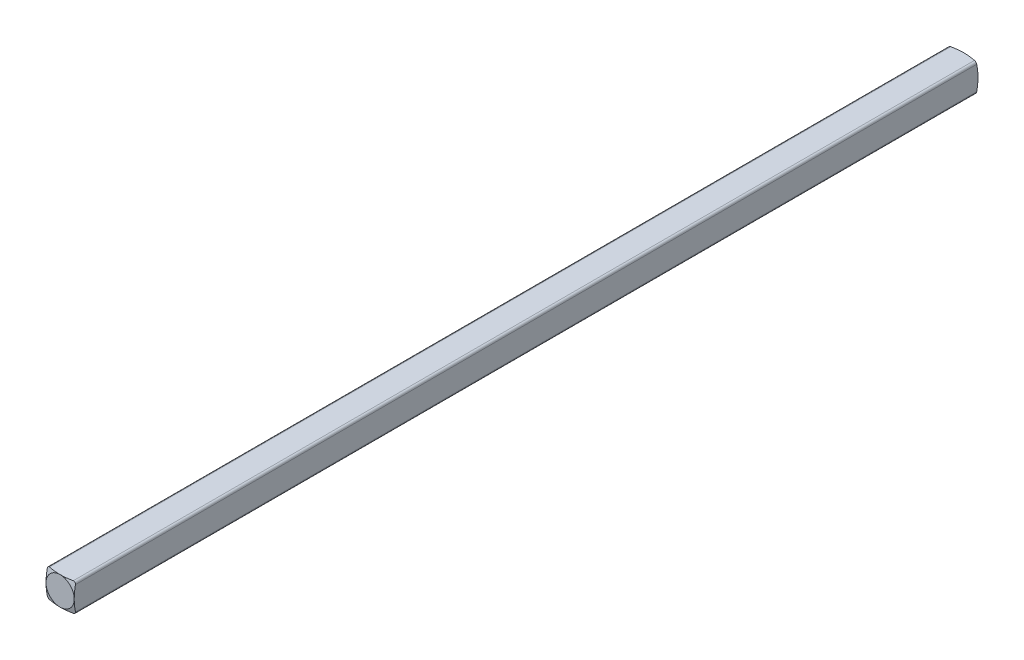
ISO-10303-21;
HEADER;
FILE_DESCRIPTION(('STEP AP214'),'2;1');
FILE_NAME('part.step','',(''),(''),'','','');
FILE_SCHEMA(('AUTOMOTIVE_DESIGN { 1 0 10303 214 1 1 1 1 }'));
ENDSEC;
DATA;
#1=APPLICATION_CONTEXT('core data for automotive mechanical design processes');
#2=APPLICATION_PROTOCOL_DEFINITION('international standard','automotive_design',2000,#1);
#3=PRODUCT_CONTEXT('',#1,'mechanical');
#4=PRODUCT('Part','Part','',(#3));
#5=PRODUCT_RELATED_PRODUCT_CATEGORY('part','',(#4));
#6=PRODUCT_DEFINITION_FORMATION('','',#4);
#7=PRODUCT_DEFINITION_CONTEXT('part definition',#1,'design');
#8=PRODUCT_DEFINITION('design','',#6,#7);
#9=PRODUCT_DEFINITION_SHAPE('','',#8);
#10=(LENGTH_UNIT() NAMED_UNIT(*) SI_UNIT(.MILLI.,.METRE.));
#11=(NAMED_UNIT(*) PLANE_ANGLE_UNIT() SI_UNIT($,.RADIAN.));
#12=(NAMED_UNIT(*) SI_UNIT($,.STERADIAN.) SOLID_ANGLE_UNIT());
#13=UNCERTAINTY_MEASURE_WITH_UNIT(LENGTH_MEASURE(1.E-05),#10,'distance_accuracy_value','');
#14=(GEOMETRIC_REPRESENTATION_CONTEXT(3) GLOBAL_UNCERTAINTY_ASSIGNED_CONTEXT((#13)) GLOBAL_UNIT_ASSIGNED_CONTEXT((#10,
#11,#12)) REPRESENTATION_CONTEXT('',''));
#15=CARTESIAN_POINT('',(0.,0.,0.));
#16=DIRECTION('',(0.,0.,1.));
#17=DIRECTION('',(1.,0.,0.));
#18=AXIS2_PLACEMENT_3D('',#15,#16,#17);
#19=CARTESIAN_POINT('',(-1.53487723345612,-1.585,50.8));
#20=DIRECTION('',(1.,0.,0.));
#21=DIRECTION('',(0.,1.,0.));
#22=AXIS2_PLACEMENT_3D('',#19,#20,#21);
#23=PLANE('',#22);
#24=CARTESIAN_POINT('',(-1.53487723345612,-3.16666521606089,-50.2259021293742));
#25=CARTESIAN_POINT('',(-1.53487723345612,-3.08469064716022,-50.2474134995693));
#26=CARTESIAN_POINT('',(-1.53487723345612,-3.00267602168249,-50.2687725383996));
#27=CARTESIAN_POINT('',(-1.53487723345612,-2.83854664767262,-50.3111088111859));
#28=CARTESIAN_POINT('',(-1.53487723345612,-2.75643189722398,-50.3320860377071));
#29=CARTESIAN_POINT('',(-1.53487723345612,-2.50995900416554,-50.3943162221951));
#30=CARTESIAN_POINT('',(-1.53487723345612,-2.3454255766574,-50.43488001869));
#31=CARTESIAN_POINT('',(-1.53487723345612,-2.01672815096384,-50.5129127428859));
#32=CARTESIAN_POINT('',(-1.53487723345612,-1.85256851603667,-50.550399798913));
#33=CARTESIAN_POINT('',(-1.53487723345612,-1.52315459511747,-50.6208840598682));
#34=CARTESIAN_POINT('',(-1.53487723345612,-1.3578996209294,-50.6538780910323));
#35=CARTESIAN_POINT('',(-1.53487723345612,-1.02346692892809,-50.7128592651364));
#36=CARTESIAN_POINT('',(-1.53487723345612,-0.854267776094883,-50.7387322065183));
#37=CARTESIAN_POINT('',(-1.53487723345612,-0.599515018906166,-50.768359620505));
#38=CARTESIAN_POINT('',(-1.53487723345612,-0.514501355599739,-50.7767023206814));
#39=CARTESIAN_POINT('',(-1.53487723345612,-0.344193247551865,-50.7897696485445));
#40=CARTESIAN_POINT('',(-1.53487723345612,-0.25889881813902,-50.7944944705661));
#41=CARTESIAN_POINT('',(-1.53487723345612,-0.0877661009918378,-50.7999590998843));
#42=CARTESIAN_POINT('',(-1.53487723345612,-0.00192717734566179,-50.8006795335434));
#43=CARTESIAN_POINT('',(-1.53487723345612,0.169686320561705,-50.79801863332));
#44=CARTESIAN_POINT('',(-1.53487723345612,0.255460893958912,-50.7946372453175));
#45=CARTESIAN_POINT('',(-1.53487723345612,0.426896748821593,-50.7840536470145));
#46=CARTESIAN_POINT('',(-1.53487723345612,0.51255766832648,-50.7768457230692));
#47=CARTESIAN_POINT('',(-1.53487723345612,0.683531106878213,-50.7591333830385));
#48=CARTESIAN_POINT('',(-1.53487723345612,0.768843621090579,-50.7486289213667));
#49=CARTESIAN_POINT('',(-1.53487723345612,0.974055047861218,-50.7200668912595));
#50=CARTESIAN_POINT('',(-1.53487723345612,1.09376665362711,-50.7006791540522));
#51=CARTESIAN_POINT('',(-1.53487723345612,1.33251777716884,-50.6580930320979));
#52=CARTESIAN_POINT('',(-1.53487723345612,1.45155714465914,-50.6348938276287));
#53=CARTESIAN_POINT('',(-1.53487723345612,1.68916216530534,-50.5858147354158));
#54=CARTESIAN_POINT('',(-1.53487723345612,1.80772743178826,-50.559932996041));
#55=CARTESIAN_POINT('',(-1.53487723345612,2.04441891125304,-50.5062944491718));
#56=CARTESIAN_POINT('',(-1.53487723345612,2.16254515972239,-50.4785377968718));
#57=CARTESIAN_POINT('',(-1.53487723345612,2.39875520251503,-50.421613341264));
#58=CARTESIAN_POINT('',(-1.53487723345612,2.51683821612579,-50.3924423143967));
#59=CARTESIAN_POINT('',(-1.53487723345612,2.75275603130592,-50.3331112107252));
#60=CARTESIAN_POINT('',(-1.53487723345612,2.87059082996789,-50.3029511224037));
#61=CARTESIAN_POINT('',(-1.53487723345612,3.22371274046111,-50.2114063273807));
#62=CARTESIAN_POINT('',(-1.53487723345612,3.45871696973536,-50.1489325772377));
#63=CARTESIAN_POINT('',(-1.53487723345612,3.92636425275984,-50.0228008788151));
#64=CARTESIAN_POINT('',(-1.53487723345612,4.15901102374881,-49.9591566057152));
#65=CARTESIAN_POINT('',(-1.53487723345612,4.62403801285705,-49.8307856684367));
#66=CARTESIAN_POINT('',(-1.53487723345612,4.85641819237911,-49.7660588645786));
#67=CARTESIAN_POINT('',(-1.53487723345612,5.31976447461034,-49.6362295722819));
#68=CARTESIAN_POINT('',(-1.53487723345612,5.55073162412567,-49.5711308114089));
#69=CARTESIAN_POINT('',(-1.53487723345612,6.01248807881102,-49.4404294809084));
#70=CARTESIAN_POINT('',(-1.53487723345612,6.24327740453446,-49.3748269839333));
#71=CARTESIAN_POINT('',(-1.53487723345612,6.47402102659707,-49.3090655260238));
#72=B_SPLINE_CURVE_WITH_KNOTS('',3,(#24,#25,#26,#27,#28,#29,#30,#31,#32,#33,#34,#35,#36,#37,#38,
#39,#40,#41,#42,#43,#44,#45,#46,#47,#48,#49,#50,#51,#52,#53,#54,#55,#56,#57,#58,#59,#60,#61,#62,
#63,#64,#65,#66,#67,#68,#69,#70,#71),.UNSPECIFIED.,.F.,.F.,(4,2,2,2,2,2,2,2,2,2,2,2,2,2,2,2,2,2,
2,2,2,2,2,4),(0.,0.254249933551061,0.508504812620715,1.01686983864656,1.52198475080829,
2.02745463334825,2.54061232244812,2.79681427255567,3.05300245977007,3.31042903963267,
3.56785901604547,3.82567446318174,4.08349347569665,4.4472125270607,4.8110099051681,
5.17506008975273,5.53908017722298,5.90397296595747,6.26887000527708,6.99835638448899,
7.72193914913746,8.44561600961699,9.16551335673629,9.88530875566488),.UNSPECIFIED.);
#73=CARTESIAN_POINT('',(-1.53487723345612,0.,-50.8));
#74=VERTEX_POINT('',#73);
#75=CARTESIAN_POINT('',(-1.53487723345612,-1.335,-50.65698643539));
#76=VERTEX_POINT('',#75);
#77=EDGE_CURVE('E126',#74,#76,#72,.F.);
#78=ORIENTED_EDGE('',*,*,#77,.T.);
#79=DIRECTION('',(0.,0.,-1.));
#80=VECTOR('',#79,1.);
#81=CARTESIAN_POINT('',(-1.53487723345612,-1.335,50.8));
#82=LINE('',#81,#80);
#83=CARTESIAN_POINT('',(-1.53487723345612,-1.335,50.65698643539));
#84=VERTEX_POINT('',#83);
#85=EDGE_CURVE('E56',#76,#84,#82,.F.);
#86=ORIENTED_EDGE('',*,*,#85,.T.);
#87=CARTESIAN_POINT('',(-1.53487723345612,-3.16666521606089,50.2259021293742));
#88=CARTESIAN_POINT('',(-1.53487723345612,-3.08469064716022,50.2474134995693));
#89=CARTESIAN_POINT('',(-1.53487723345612,-3.00267602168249,50.2687725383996));
#90=CARTESIAN_POINT('',(-1.53487723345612,-2.83854664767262,50.3111088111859));
#91=CARTESIAN_POINT('',(-1.53487723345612,-2.75643189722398,50.3320860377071));
#92=CARTESIAN_POINT('',(-1.53487723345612,-2.50995900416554,50.3943162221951));
#93=CARTESIAN_POINT('',(-1.53487723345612,-2.3454255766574,50.43488001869));
#94=CARTESIAN_POINT('',(-1.53487723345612,-2.01672815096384,50.5129127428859));
#95=CARTESIAN_POINT('',(-1.53487723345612,-1.85256851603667,50.550399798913));
#96=CARTESIAN_POINT('',(-1.53487723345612,-1.52315459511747,50.6208840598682));
#97=CARTESIAN_POINT('',(-1.53487723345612,-1.3578996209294,50.6538780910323));
#98=CARTESIAN_POINT('',(-1.53487723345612,-1.02346692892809,50.7128592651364));
#99=CARTESIAN_POINT('',(-1.53487723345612,-0.854267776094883,50.7387322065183));
#100=CARTESIAN_POINT('',(-1.53487723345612,-0.599515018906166,50.768359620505));
#101=CARTESIAN_POINT('',(-1.53487723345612,-0.514501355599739,50.7767023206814));
#102=CARTESIAN_POINT('',(-1.53487723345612,-0.344193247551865,50.7897696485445));
#103=CARTESIAN_POINT('',(-1.53487723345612,-0.25889881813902,50.7944944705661));
#104=CARTESIAN_POINT('',(-1.53487723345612,-0.0877661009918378,50.7999590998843));
#105=CARTESIAN_POINT('',(-1.53487723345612,-0.00192717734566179,50.8006795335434));
#106=CARTESIAN_POINT('',(-1.53487723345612,0.169686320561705,50.79801863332));
#107=CARTESIAN_POINT('',(-1.53487723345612,0.255460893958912,50.7946372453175));
#108=CARTESIAN_POINT('',(-1.53487723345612,0.426896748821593,50.7840536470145));
#109=CARTESIAN_POINT('',(-1.53487723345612,0.51255766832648,50.7768457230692));
#110=CARTESIAN_POINT('',(-1.53487723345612,0.683531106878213,50.7591333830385));
#111=CARTESIAN_POINT('',(-1.53487723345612,0.768843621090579,50.7486289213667));
#112=CARTESIAN_POINT('',(-1.53487723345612,0.974055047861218,50.7200668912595));
#113=CARTESIAN_POINT('',(-1.53487723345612,1.09376665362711,50.7006791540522));
#114=CARTESIAN_POINT('',(-1.53487723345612,1.33251777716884,50.6580930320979));
#115=CARTESIAN_POINT('',(-1.53487723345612,1.45155714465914,50.6348938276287));
#116=CARTESIAN_POINT('',(-1.53487723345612,1.68916216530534,50.5858147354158));
#117=CARTESIAN_POINT('',(-1.53487723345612,1.80772743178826,50.559932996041));
#118=CARTESIAN_POINT('',(-1.53487723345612,2.04441891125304,50.5062944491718));
#119=CARTESIAN_POINT('',(-1.53487723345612,2.16254515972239,50.4785377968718));
#120=CARTESIAN_POINT('',(-1.53487723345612,2.39875520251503,50.421613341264));
#121=CARTESIAN_POINT('',(-1.53487723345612,2.51683821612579,50.3924423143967));
#122=CARTESIAN_POINT('',(-1.53487723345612,2.75275603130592,50.3331112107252));
#123=CARTESIAN_POINT('',(-1.53487723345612,2.87059082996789,50.3029511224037));
#124=CARTESIAN_POINT('',(-1.53487723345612,3.22371274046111,50.2114063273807));
#125=CARTESIAN_POINT('',(-1.53487723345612,3.45871696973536,50.1489325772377));
#126=CARTESIAN_POINT('',(-1.53487723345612,3.92636425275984,50.0228008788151));
#127=CARTESIAN_POINT('',(-1.53487723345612,4.15901102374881,49.9591566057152));
#128=CARTESIAN_POINT('',(-1.53487723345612,4.62403801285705,49.8307856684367));
#129=CARTESIAN_POINT('',(-1.53487723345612,4.85641819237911,49.7660588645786));
#130=CARTESIAN_POINT('',(-1.53487723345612,5.31976447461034,49.6362295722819));
#131=CARTESIAN_POINT('',(-1.53487723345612,5.55073162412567,49.5711308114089));
#132=CARTESIAN_POINT('',(-1.53487723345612,6.01248807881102,49.4404294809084));
#133=CARTESIAN_POINT('',(-1.53487723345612,6.24327740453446,49.3748269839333));
#134=CARTESIAN_POINT('',(-1.53487723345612,6.47402102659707,49.3090655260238));
#135=B_SPLINE_CURVE_WITH_KNOTS('',3,(#87,#88,#89,#90,#91,#92,#93,#94,#95,#96,#97,#98,#99,#100,
#101,#102,#103,#104,#105,#106,#107,#108,#109,#110,#111,#112,#113,#114,#115,#116,#117,#118,#119,
#120,#121,#122,#123,#124,#125,#126,#127,#128,#129,#130,#131,#132,#133,#134),.UNSPECIFIED.,.F.,
.F.,(4,2,2,2,2,2,2,2,2,2,2,2,2,2,2,2,2,2,2,2,2,2,2,4),(0.,0.254249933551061,0.508504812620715,
1.01686983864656,1.52198475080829,2.02745463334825,2.54061232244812,2.79681427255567,
3.05300245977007,3.31042903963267,3.56785901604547,3.82567446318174,4.08349347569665,
4.4472125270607,4.8110099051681,5.17506008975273,5.53908017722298,5.90397296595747,
6.26887000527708,6.99835638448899,7.72193914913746,8.44561600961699,9.16551335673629,
9.88530875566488),.UNSPECIFIED.);
#136=CARTESIAN_POINT('',(-1.53487723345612,0.,50.8));
#137=VERTEX_POINT('',#136);
#138=EDGE_CURVE('E453',#84,#137,#135,.T.);
#139=ORIENTED_EDGE('',*,*,#138,.T.);
#140=CARTESIAN_POINT('',(-1.53487723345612,1.33500000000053,50.6569864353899));
#141=VERTEX_POINT('',#140);
#142=EDGE_CURVE('E187',#137,#141,#135,.T.);
#143=ORIENTED_EDGE('',*,*,#142,.T.);
#144=DIRECTION('',(0.,0.,-1.));
#145=VECTOR('',#144,1.);
#146=CARTESIAN_POINT('',(-1.53487723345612,1.335,50.8));
#147=LINE('',#146,#145);
#148=CARTESIAN_POINT('',(-1.53487723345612,1.33500000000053,-50.6569864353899));
#149=VERTEX_POINT('',#148);
#150=EDGE_CURVE('E128',#141,#149,#147,.T.);
#151=ORIENTED_EDGE('',*,*,#150,.T.);
#152=EDGE_CURVE('E124',#149,#74,#72,.F.);
#153=ORIENTED_EDGE('',*,*,#152,.T.);
#154=EDGE_LOOP('',(#78,#86,#139,#143,#151,#153));
#155=FACE_BOUND('',#154,.T.);
#156=ADVANCED_FACE('F30',(#155),#23,.F.);
#157=CARTESIAN_POINT('',(-1.53487723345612,-1.585,50.8));
#158=DIRECTION('',(0.,1.,0.));
#159=DIRECTION('',(-1.,0.,0.));
#160=AXIS2_PLACEMENT_3D('',#157,#158,#159);
#161=PLANE('',#160);
#162=CARTESIAN_POINT('',(-3.11654636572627,-1.585,-50.2259011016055));
#163=CARTESIAN_POINT('',(-3.03457163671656,-1.585,-50.2474125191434));
#164=CARTESIAN_POINT('',(-2.95255685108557,-1.585,-50.2687716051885));
#165=CARTESIAN_POINT('',(-2.78842715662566,-1.585,-50.3111079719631));
#166=CARTESIAN_POINT('',(-2.70631224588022,-1.585,-50.332085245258));
#167=CARTESIAN_POINT('',(-2.45983887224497,-1.585,-50.3943155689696));
#168=CARTESIAN_POINT('',(-2.2953051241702,-1.585,-50.4348794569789));
#169=CARTESIAN_POINT('',(-1.96660706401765,-1.585,-50.5129123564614));
#170=CARTESIAN_POINT('',(-1.80244711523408,-1.585,-50.5503994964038));
#171=CARTESIAN_POINT('',(-1.4730325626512,-1.585,-50.6208839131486));
#172=CARTESIAN_POINT('',(-1.30777727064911,-1.585,-50.6538780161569));
#173=CARTESIAN_POINT('',(-0.973343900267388,-1.585,-50.7128593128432));
#174=CARTESIAN_POINT('',(-0.804144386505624,-1.585,-50.7387323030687));
#175=CARTESIAN_POINT('',(-0.549391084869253,-1.585,-50.7683597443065));
#176=CARTESIAN_POINT('',(-0.464377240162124,-1.585,-50.7767024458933));
#177=CARTESIAN_POINT('',(-0.294068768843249,-1.585,-50.7897697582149));
#178=CARTESIAN_POINT('',(-0.20877415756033,-1.585,-50.7944945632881));
#179=CARTESIAN_POINT('',(-0.0376410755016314,-1.585,-50.7999591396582));
#180=CARTESIAN_POINT('',(0.048198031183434,-1.585,-50.800679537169));
#181=CARTESIAN_POINT('',(0.219811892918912,-1.585,-50.7980185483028));
#182=CARTESIAN_POINT('',(0.305586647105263,-1.585,-50.7946371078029));
#183=CARTESIAN_POINT('',(0.477022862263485,-1.585,-50.784053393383));
#184=CARTESIAN_POINT('',(0.562683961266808,-1.585,-50.7768454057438));
#185=CARTESIAN_POINT('',(0.733657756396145,-1.585,-50.75913293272));
#186=CARTESIAN_POINT('',(0.818970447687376,-1.585,-50.7486284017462));
#187=CARTESIAN_POINT('',(1.02418204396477,-1.585,-50.7200662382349));
#188=CARTESIAN_POINT('',(1.14389364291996,-1.585,-50.7006784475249));
#189=CARTESIAN_POINT('',(1.38264475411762,-1.585,-50.6580922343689));
#190=CARTESIAN_POINT('',(1.50168411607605,-1.585,-50.6348929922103));
#191=CARTESIAN_POINT('',(1.73928912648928,-1.585,-50.5858138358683));
#192=CARTESIAN_POINT('',(1.8578543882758,-1.585,-50.5599320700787));
#193=CARTESIAN_POINT('',(2.09454585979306,-1.585,-50.5062934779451));
#194=CARTESIAN_POINT('',(2.21267210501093,-1.585,-50.4785368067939));
#195=CARTESIAN_POINT('',(2.44888213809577,-1.585,-50.4216123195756));
#196=CARTESIAN_POINT('',(2.56696514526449,-1.585,-50.3924412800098));
#197=CARTESIAN_POINT('',(2.80288294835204,-1.585,-50.3331101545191));
#198=CARTESIAN_POINT('',(2.92071774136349,-1.585,-50.302950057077));
#199=CARTESIAN_POINT('',(3.273839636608,-1.585,-50.2114052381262));
#200=CARTESIAN_POINT('',(3.50884385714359,-1.585,-50.1489314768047));
#201=CARTESIAN_POINT('',(3.9764911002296,-1.585,-50.0227997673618));
#202=CARTESIAN_POINT('',(4.20913784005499,-1.585,-49.9591554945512));
#203=CARTESIAN_POINT('',(4.67416476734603,-1.585,-49.8307845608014));
#204=CARTESIAN_POINT('',(4.90654491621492,-1.585,-49.7660577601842));
#205=CARTESIAN_POINT('',(5.36989115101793,-1.585,-49.6362284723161));
#206=CARTESIAN_POINT('',(5.6008582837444,-1.585,-49.5711297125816));
#207=CARTESIAN_POINT('',(6.06261470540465,-1.585,-49.4404283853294));
#208=CARTESIAN_POINT('',(6.29340401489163,-1.585,-49.3748258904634));
#209=CARTESIAN_POINT('',(6.5241476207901,-1.585,-49.3090644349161));
#210=B_SPLINE_CURVE_WITH_KNOTS('',3,(#162,#163,#164,#165,#166,#167,#168,#169,#170,#171,#172,
#173,#174,#175,#176,#177,#178,#179,#180,#181,#182,#183,#184,#185,#186,#187,#188,#189,#190,#191,
#192,#193,#194,#195,#196,#197,#198,#199,#200,#201,#202,#203,#204,#205,#206,#207,#208,#209),
.UNSPECIFIED.,.F.,.F.,(4,2,2,2,2,2,2,2,2,2,2,2,2,2,2,2,2,2,2,2,2,2,2,4),(0.,0.25425043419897,
0.508505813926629,1.01687183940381,1.52198772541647,2.02745858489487,2.54061736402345,
2.79681985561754,3.05300858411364,3.31043571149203,3.56786623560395,3.82568223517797,
4.08350180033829,4.44722085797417,4.81101824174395,5.1750684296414,5.53908852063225,
5.90398129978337,6.26887832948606,6.99836469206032,7.72194736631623,8.44562413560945,
9.16552143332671,9.88531678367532),.UNSPECIFIED.);
#211=CARTESIAN_POINT('',(0.0501227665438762,-1.585,-50.8));
#212=VERTEX_POINT('',#211);
#213=CARTESIAN_POINT('',(1.38512276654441,-1.585,-50.6569864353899));
#214=VERTEX_POINT('',#213);
#215=EDGE_CURVE('E208',#212,#214,#210,.T.);
#216=ORIENTED_EDGE('',*,*,#215,.T.);
#217=DIRECTION('',(0.,0.,-1.));
#218=VECTOR('',#217,1.);
#219=CARTESIAN_POINT('',(1.38512276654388,-1.585,50.8));
#220=LINE('',#219,#218);
#221=CARTESIAN_POINT('',(1.38512276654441,-1.585,50.6569864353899));
#222=VERTEX_POINT('',#221);
#223=EDGE_CURVE('E426',#214,#222,#220,.F.);
#224=ORIENTED_EDGE('',*,*,#223,.T.);
#225=CARTESIAN_POINT('',(-3.11654636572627,-1.585,50.2259011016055));
#226=CARTESIAN_POINT('',(-3.03457163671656,-1.585,50.2474125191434));
#227=CARTESIAN_POINT('',(-2.95255685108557,-1.585,50.2687716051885));
#228=CARTESIAN_POINT('',(-2.78842715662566,-1.585,50.3111079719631));
#229=CARTESIAN_POINT('',(-2.70631224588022,-1.585,50.332085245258));
#230=CARTESIAN_POINT('',(-2.45983887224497,-1.585,50.3943155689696));
#231=CARTESIAN_POINT('',(-2.2953051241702,-1.585,50.4348794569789));
#232=CARTESIAN_POINT('',(-1.96660706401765,-1.585,50.5129123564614));
#233=CARTESIAN_POINT('',(-1.80244711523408,-1.585,50.5503994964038));
#234=CARTESIAN_POINT('',(-1.4730325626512,-1.585,50.6208839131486));
#235=CARTESIAN_POINT('',(-1.30777727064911,-1.585,50.6538780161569));
#236=CARTESIAN_POINT('',(-0.973343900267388,-1.585,50.7128593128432));
#237=CARTESIAN_POINT('',(-0.804144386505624,-1.585,50.7387323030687));
#238=CARTESIAN_POINT('',(-0.549391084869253,-1.585,50.7683597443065));
#239=CARTESIAN_POINT('',(-0.464377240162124,-1.585,50.7767024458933));
#240=CARTESIAN_POINT('',(-0.294068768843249,-1.585,50.7897697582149));
#241=CARTESIAN_POINT('',(-0.20877415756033,-1.585,50.7944945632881));
#242=CARTESIAN_POINT('',(-0.0376410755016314,-1.585,50.7999591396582));
#243=CARTESIAN_POINT('',(0.048198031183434,-1.585,50.800679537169));
#244=CARTESIAN_POINT('',(0.219811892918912,-1.585,50.7980185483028));
#245=CARTESIAN_POINT('',(0.305586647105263,-1.585,50.7946371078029));
#246=CARTESIAN_POINT('',(0.477022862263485,-1.585,50.784053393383));
#247=CARTESIAN_POINT('',(0.562683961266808,-1.585,50.7768454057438));
#248=CARTESIAN_POINT('',(0.733657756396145,-1.585,50.75913293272));
#249=CARTESIAN_POINT('',(0.818970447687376,-1.585,50.7486284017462));
#250=CARTESIAN_POINT('',(1.02418204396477,-1.585,50.7200662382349));
#251=CARTESIAN_POINT('',(1.14389364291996,-1.585,50.7006784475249));
#252=CARTESIAN_POINT('',(1.38264475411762,-1.585,50.6580922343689));
#253=CARTESIAN_POINT('',(1.50168411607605,-1.585,50.6348929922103));
#254=CARTESIAN_POINT('',(1.73928912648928,-1.585,50.5858138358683));
#255=CARTESIAN_POINT('',(1.8578543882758,-1.585,50.5599320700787));
#256=CARTESIAN_POINT('',(2.09454585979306,-1.585,50.5062934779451));
#257=CARTESIAN_POINT('',(2.21267210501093,-1.585,50.4785368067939));
#258=CARTESIAN_POINT('',(2.44888213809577,-1.585,50.4216123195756));
#259=CARTESIAN_POINT('',(2.56696514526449,-1.585,50.3924412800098));
#260=CARTESIAN_POINT('',(2.80288294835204,-1.585,50.3331101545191));
#261=CARTESIAN_POINT('',(2.92071774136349,-1.585,50.302950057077));
#262=CARTESIAN_POINT('',(3.273839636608,-1.585,50.2114052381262));
#263=CARTESIAN_POINT('',(3.50884385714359,-1.585,50.1489314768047));
#264=CARTESIAN_POINT('',(3.9764911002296,-1.585,50.0227997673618));
#265=CARTESIAN_POINT('',(4.20913784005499,-1.585,49.9591554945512));
#266=CARTESIAN_POINT('',(4.67416476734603,-1.585,49.8307845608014));
#267=CARTESIAN_POINT('',(4.90654491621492,-1.585,49.7660577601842));
#268=CARTESIAN_POINT('',(5.36989115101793,-1.585,49.6362284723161));
#269=CARTESIAN_POINT('',(5.6008582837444,-1.585,49.5711297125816));
#270=CARTESIAN_POINT('',(6.06261470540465,-1.585,49.4404283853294));
#271=CARTESIAN_POINT('',(6.29340401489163,-1.585,49.3748258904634));
#272=CARTESIAN_POINT('',(6.5241476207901,-1.585,49.3090644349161));
#273=B_SPLINE_CURVE_WITH_KNOTS('',3,(#225,#226,#227,#228,#229,#230,#231,#232,#233,#234,#235,
#236,#237,#238,#239,#240,#241,#242,#243,#244,#245,#246,#247,#248,#249,#250,#251,#252,#253,#254,
#255,#256,#257,#258,#259,#260,#261,#262,#263,#264,#265,#266,#267,#268,#269,#270,#271,#272),
.UNSPECIFIED.,.F.,.F.,(4,2,2,2,2,2,2,2,2,2,2,2,2,2,2,2,2,2,2,2,2,2,2,4),(0.,0.25425043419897,
0.508505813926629,1.01687183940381,1.52198772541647,2.02745858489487,2.54061736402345,
2.79681985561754,3.05300858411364,3.31043571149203,3.56786623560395,3.82568223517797,
4.08350180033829,4.44722085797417,4.81101824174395,5.1750684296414,5.53908852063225,
5.90398129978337,6.26887832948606,6.99836469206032,7.72194736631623,8.44562413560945,
9.16552143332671,9.88531678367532),.UNSPECIFIED.);
#274=CARTESIAN_POINT('',(0.0501227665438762,-1.585,50.8));
#275=VERTEX_POINT('',#274);
#276=EDGE_CURVE('E174',#222,#275,#273,.F.);
#277=ORIENTED_EDGE('',*,*,#276,.T.);
#278=CARTESIAN_POINT('',(-1.28487723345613,-1.585,50.65698643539));
#279=VERTEX_POINT('',#278);
#280=EDGE_CURVE('E176',#275,#279,#273,.F.);
#281=ORIENTED_EDGE('',*,*,#280,.T.);
#282=DIRECTION('',(0.,0.,-1.));
#283=VECTOR('',#282,1.);
#284=CARTESIAN_POINT('',(-1.28487723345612,-1.585,50.8));
#285=LINE('',#284,#283);
#286=CARTESIAN_POINT('',(-1.28487723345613,-1.585,-50.65698643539));
#287=VERTEX_POINT('',#286);
#288=EDGE_CURVE('E431',#279,#287,#285,.T.);
#289=ORIENTED_EDGE('',*,*,#288,.T.);
#290=EDGE_CURVE('E141',#287,#212,#210,.T.);
#291=ORIENTED_EDGE('',*,*,#290,.T.);
#292=EDGE_LOOP('',(#216,#224,#277,#281,#289,#291));
#293=FACE_BOUND('',#292,.T.);
#294=ADVANCED_FACE('F197',(#293),#161,.F.);
#295=CARTESIAN_POINT('',(1.63512276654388,-1.585,50.8));
#296=DIRECTION('',(-1.,0.,0.));
#297=DIRECTION('',(0.,-1.,0.));
#298=AXIS2_PLACEMENT_3D('',#295,#296,#297);
#299=PLANE('',#298);
#300=CARTESIAN_POINT('',(1.63512276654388,-3.16666913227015,-50.2259011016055));
#301=CARTESIAN_POINT('',(1.63512276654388,-3.08469440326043,-50.2474125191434));
#302=CARTESIAN_POINT('',(1.63512276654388,-3.00267961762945,-50.2687716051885));
#303=CARTESIAN_POINT('',(1.63512276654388,-2.83854992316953,-50.3111079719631));
#304=CARTESIAN_POINT('',(1.63512276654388,-2.7564350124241,-50.332085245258));
#305=CARTESIAN_POINT('',(1.63512276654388,-2.50996163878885,-50.3943155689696));
#306=CARTESIAN_POINT('',(1.63512276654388,-2.34542789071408,-50.4348794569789));
#307=CARTESIAN_POINT('',(1.63512276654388,-2.01672983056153,-50.5129123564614));
#308=CARTESIAN_POINT('',(1.63512276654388,-1.85256988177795,-50.5503994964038));
#309=CARTESIAN_POINT('',(1.63512276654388,-1.52315532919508,-50.6208839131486));
#310=CARTESIAN_POINT('',(1.63512276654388,-1.35790003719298,-50.6538780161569));
#311=CARTESIAN_POINT('',(1.63512276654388,-1.02346666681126,-50.7128593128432));
#312=CARTESIAN_POINT('',(1.63512276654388,-0.8542671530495,-50.7387323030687));
#313=CARTESIAN_POINT('',(1.63512276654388,-0.599513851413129,-50.7683597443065));
#314=CARTESIAN_POINT('',(1.63512276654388,-0.514500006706,-50.7767024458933));
#315=CARTESIAN_POINT('',(1.63512276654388,-0.344191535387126,-50.7897697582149));
#316=CARTESIAN_POINT('',(1.63512276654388,-0.258896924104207,-50.7944945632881));
#317=CARTESIAN_POINT('',(1.63512276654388,-0.0877638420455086,-50.7999591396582));
#318=CARTESIAN_POINT('',(1.63512276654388,-0.00192473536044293,-50.800679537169));
#319=CARTESIAN_POINT('',(1.63512276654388,0.169689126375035,-50.7980185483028));
#320=CARTESIAN_POINT('',(1.63512276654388,0.255463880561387,-50.7946371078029));
#321=CARTESIAN_POINT('',(1.63512276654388,0.426900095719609,-50.784053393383));
#322=CARTESIAN_POINT('',(1.63512276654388,0.512561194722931,-50.7768454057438));
#323=CARTESIAN_POINT('',(1.63512276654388,0.683534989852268,-50.75913293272));
#324=CARTESIAN_POINT('',(1.63512276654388,0.768847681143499,-50.7486284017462));
#325=CARTESIAN_POINT('',(1.63512276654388,0.97405927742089,-50.7200662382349));
#326=CARTESIAN_POINT('',(1.63512276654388,1.09377087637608,-50.7006784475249));
#327=CARTESIAN_POINT('',(1.63512276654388,1.33252198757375,-50.6580922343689));
#328=CARTESIAN_POINT('',(1.63512276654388,1.45156134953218,-50.6348929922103));
#329=CARTESIAN_POINT('',(1.63512276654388,1.68916635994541,-50.5858138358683));
#330=CARTESIAN_POINT('',(1.63512276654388,1.80773162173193,-50.5599320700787));
#331=CARTESIAN_POINT('',(1.63512276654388,2.04442309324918,-50.5062934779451));
#332=CARTESIAN_POINT('',(1.63512276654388,2.16254933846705,-50.4785368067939));
#333=CARTESIAN_POINT('',(1.63512276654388,2.39875937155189,-50.4216123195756));
#334=CARTESIAN_POINT('',(1.63512276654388,2.51684237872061,-50.3924412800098));
#335=CARTESIAN_POINT('',(1.63512276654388,2.75276018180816,-50.3331101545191));
#336=CARTESIAN_POINT('',(1.63512276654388,2.87059497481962,-50.302950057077));
#337=CARTESIAN_POINT('',(1.63512276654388,3.22371687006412,-50.2114052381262));
#338=CARTESIAN_POINT('',(1.63512276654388,3.45872109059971,-50.1489314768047));
#339=CARTESIAN_POINT('',(1.63512276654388,3.92636833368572,-50.0227997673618));
#340=CARTESIAN_POINT('',(1.63512276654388,4.15901507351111,-49.9591554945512));
#341=CARTESIAN_POINT('',(1.63512276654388,4.62404200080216,-49.8307845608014));
#342=CARTESIAN_POINT('',(1.63512276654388,4.85642214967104,-49.7660577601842));
#343=CARTESIAN_POINT('',(1.63512276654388,5.31976838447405,-49.6362284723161));
#344=CARTESIAN_POINT('',(1.63512276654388,5.55073551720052,-49.5711297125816));
#345=CARTESIAN_POINT('',(1.63512276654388,6.01249193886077,-49.4404283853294));
#346=CARTESIAN_POINT('',(1.63512276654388,6.24328124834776,-49.3748258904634));
#347=CARTESIAN_POINT('',(1.63512276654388,6.47402485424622,-49.3090644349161));
#348=B_SPLINE_CURVE_WITH_KNOTS('',3,(#300,#301,#302,#303,#304,#305,#306,#307,#308,#309,#310,
#311,#312,#313,#314,#315,#316,#317,#318,#319,#320,#321,#322,#323,#324,#325,#326,#327,#328,#329,
#330,#331,#332,#333,#334,#335,#336,#337,#338,#339,#340,#341,#342,#343,#344,#345,#346,#347),
.UNSPECIFIED.,.F.,.F.,(4,2,2,2,2,2,2,2,2,2,2,2,2,2,2,2,2,2,2,2,2,2,2,4),(0.,0.25425043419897,
0.508505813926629,1.01687183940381,1.52198772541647,2.02745858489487,2.54061736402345,
2.79681985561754,3.05300858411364,3.31043571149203,3.56786623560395,3.82568223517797,
4.08350180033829,4.44722085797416,4.81101824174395,5.1750684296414,5.53908852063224,
5.90398129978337,6.26887832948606,6.99836469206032,7.72194736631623,8.44562413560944,
9.16552143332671,9.88531678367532),.UNSPECIFIED.);
#349=CARTESIAN_POINT('',(1.63512276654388,0.,-50.8));
#350=VERTEX_POINT('',#349);
#351=CARTESIAN_POINT('',(1.63512276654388,1.33500000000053,-50.6569864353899));
#352=VERTEX_POINT('',#351);
#353=EDGE_CURVE('E215',#350,#352,#348,.T.);
#354=ORIENTED_EDGE('',*,*,#353,.T.);
#355=DIRECTION('',(0.,0.,-1.));
#356=VECTOR('',#355,1.);
#357=CARTESIAN_POINT('',(1.63512276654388,1.335,50.8));
#358=LINE('',#357,#356);
#359=CARTESIAN_POINT('',(1.63512276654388,1.33500000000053,50.6569864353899));
#360=VERTEX_POINT('',#359);
#361=EDGE_CURVE('E437',#352,#360,#358,.F.);
#362=ORIENTED_EDGE('',*,*,#361,.T.);
#363=CARTESIAN_POINT('',(1.63512276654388,-3.16666913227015,50.2259011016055));
#364=CARTESIAN_POINT('',(1.63512276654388,-3.08469440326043,50.2474125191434));
#365=CARTESIAN_POINT('',(1.63512276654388,-3.00267961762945,50.2687716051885));
#366=CARTESIAN_POINT('',(1.63512276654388,-2.83854992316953,50.3111079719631));
#367=CARTESIAN_POINT('',(1.63512276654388,-2.7564350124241,50.332085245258));
#368=CARTESIAN_POINT('',(1.63512276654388,-2.50996163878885,50.3943155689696));
#369=CARTESIAN_POINT('',(1.63512276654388,-2.34542789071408,50.4348794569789));
#370=CARTESIAN_POINT('',(1.63512276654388,-2.01672983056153,50.5129123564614));
#371=CARTESIAN_POINT('',(1.63512276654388,-1.85256988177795,50.5503994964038));
#372=CARTESIAN_POINT('',(1.63512276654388,-1.52315532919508,50.6208839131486));
#373=CARTESIAN_POINT('',(1.63512276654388,-1.35790003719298,50.6538780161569));
#374=CARTESIAN_POINT('',(1.63512276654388,-1.02346666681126,50.7128593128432));
#375=CARTESIAN_POINT('',(1.63512276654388,-0.8542671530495,50.7387323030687));
#376=CARTESIAN_POINT('',(1.63512276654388,-0.599513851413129,50.7683597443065));
#377=CARTESIAN_POINT('',(1.63512276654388,-0.514500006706,50.7767024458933));
#378=CARTESIAN_POINT('',(1.63512276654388,-0.344191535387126,50.7897697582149));
#379=CARTESIAN_POINT('',(1.63512276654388,-0.258896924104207,50.7944945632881));
#380=CARTESIAN_POINT('',(1.63512276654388,-0.0877638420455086,50.7999591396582));
#381=CARTESIAN_POINT('',(1.63512276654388,-0.00192473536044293,50.800679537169));
#382=CARTESIAN_POINT('',(1.63512276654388,0.169689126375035,50.7980185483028));
#383=CARTESIAN_POINT('',(1.63512276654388,0.255463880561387,50.7946371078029));
#384=CARTESIAN_POINT('',(1.63512276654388,0.426900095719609,50.784053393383));
#385=CARTESIAN_POINT('',(1.63512276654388,0.512561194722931,50.7768454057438));
#386=CARTESIAN_POINT('',(1.63512276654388,0.683534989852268,50.75913293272));
#387=CARTESIAN_POINT('',(1.63512276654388,0.768847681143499,50.7486284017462));
#388=CARTESIAN_POINT('',(1.63512276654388,0.97405927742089,50.7200662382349));
#389=CARTESIAN_POINT('',(1.63512276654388,1.09377087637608,50.7006784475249));
#390=CARTESIAN_POINT('',(1.63512276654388,1.33252198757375,50.6580922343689));
#391=CARTESIAN_POINT('',(1.63512276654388,1.45156134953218,50.6348929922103));
#392=CARTESIAN_POINT('',(1.63512276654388,1.68916635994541,50.5858138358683));
#393=CARTESIAN_POINT('',(1.63512276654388,1.80773162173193,50.5599320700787));
#394=CARTESIAN_POINT('',(1.63512276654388,2.04442309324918,50.5062934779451));
#395=CARTESIAN_POINT('',(1.63512276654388,2.16254933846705,50.4785368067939));
#396=CARTESIAN_POINT('',(1.63512276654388,2.39875937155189,50.4216123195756));
#397=CARTESIAN_POINT('',(1.63512276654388,2.51684237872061,50.3924412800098));
#398=CARTESIAN_POINT('',(1.63512276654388,2.75276018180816,50.3331101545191));
#399=CARTESIAN_POINT('',(1.63512276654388,2.87059497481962,50.302950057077));
#400=CARTESIAN_POINT('',(1.63512276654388,3.22371687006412,50.2114052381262));
#401=CARTESIAN_POINT('',(1.63512276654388,3.45872109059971,50.1489314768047));
#402=CARTESIAN_POINT('',(1.63512276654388,3.92636833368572,50.0227997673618));
#403=CARTESIAN_POINT('',(1.63512276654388,4.15901507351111,49.9591554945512));
#404=CARTESIAN_POINT('',(1.63512276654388,4.62404200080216,49.8307845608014));
#405=CARTESIAN_POINT('',(1.63512276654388,4.85642214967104,49.7660577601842));
#406=CARTESIAN_POINT('',(1.63512276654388,5.31976838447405,49.6362284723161));
#407=CARTESIAN_POINT('',(1.63512276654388,5.55073551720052,49.5711297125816));
#408=CARTESIAN_POINT('',(1.63512276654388,6.01249193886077,49.4404283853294));
#409=CARTESIAN_POINT('',(1.63512276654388,6.24328124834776,49.3748258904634));
#410=CARTESIAN_POINT('',(1.63512276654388,6.47402485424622,49.3090644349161));
#411=B_SPLINE_CURVE_WITH_KNOTS('',3,(#363,#364,#365,#366,#367,#368,#369,#370,#371,#372,#373,
#374,#375,#376,#377,#378,#379,#380,#381,#382,#383,#384,#385,#386,#387,#388,#389,#390,#391,#392,
#393,#394,#395,#396,#397,#398,#399,#400,#401,#402,#403,#404,#405,#406,#407,#408,#409,#410),
.UNSPECIFIED.,.F.,.F.,(4,2,2,2,2,2,2,2,2,2,2,2,2,2,2,2,2,2,2,2,2,2,2,4),(0.,0.25425043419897,
0.508505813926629,1.01687183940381,1.52198772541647,2.02745858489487,2.54061736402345,
2.79681985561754,3.05300858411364,3.31043571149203,3.56786623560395,3.82568223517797,
4.08350180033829,4.44722085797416,4.81101824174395,5.1750684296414,5.53908852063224,
5.90398129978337,6.26887832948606,6.99836469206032,7.72194736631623,8.44562413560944,
9.16552143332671,9.88531678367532),.UNSPECIFIED.);
#412=CARTESIAN_POINT('',(1.63512276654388,0.,50.8));
#413=VERTEX_POINT('',#412);
#414=EDGE_CURVE('E451',#360,#413,#411,.F.);
#415=ORIENTED_EDGE('',*,*,#414,.T.);
#416=CARTESIAN_POINT('',(1.63512276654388,-1.335,50.65698643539));
#417=VERTEX_POINT('',#416);
#418=EDGE_CURVE('E181',#413,#417,#411,.F.);
#419=ORIENTED_EDGE('',*,*,#418,.T.);
#420=DIRECTION('',(0.,0.,-1.));
#421=VECTOR('',#420,1.);
#422=CARTESIAN_POINT('',(1.63512276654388,-1.335,50.8));
#423=LINE('',#422,#421);
#424=CARTESIAN_POINT('',(1.63512276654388,-1.335,-50.65698643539));
#425=VERTEX_POINT('',#424);
#426=EDGE_CURVE('E428',#417,#425,#423,.T.);
#427=ORIENTED_EDGE('',*,*,#426,.T.);
#428=EDGE_CURVE('E214',#425,#350,#348,.T.);
#429=ORIENTED_EDGE('',*,*,#428,.T.);
#430=EDGE_LOOP('',(#354,#362,#415,#419,#427,#429));
#431=FACE_BOUND('',#430,.T.);
#432=ADVANCED_FACE('F201',(#431),#299,.F.);
#433=CARTESIAN_POINT('',(-1.53487723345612,1.585,50.8));
#434=DIRECTION('',(0.,-1.,0.));
#435=DIRECTION('',(1.,0.,0.));
#436=AXIS2_PLACEMENT_3D('',#433,#434,#435);
#437=PLANE('',#436);
#438=CARTESIAN_POINT('',(-3.11654244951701,1.585,50.2259021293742));
#439=CARTESIAN_POINT('',(-3.03456788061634,1.585,50.2474134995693));
#440=CARTESIAN_POINT('',(-2.95255325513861,1.585,50.2687725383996));
#441=CARTESIAN_POINT('',(-2.78842388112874,1.585,50.3111088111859));
#442=CARTESIAN_POINT('',(-2.7063091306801,1.585,50.3320860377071));
#443=CARTESIAN_POINT('',(-2.45983623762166,1.585,50.3943162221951));
#444=CARTESIAN_POINT('',(-2.29530281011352,1.585,50.43488001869));
#445=CARTESIAN_POINT('',(-1.96660538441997,1.585,50.5129127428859));
#446=CARTESIAN_POINT('',(-1.80244574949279,1.585,50.550399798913));
#447=CARTESIAN_POINT('',(-1.47303182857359,1.585,50.6208840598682));
#448=CARTESIAN_POINT('',(-1.30777685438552,1.585,50.6538780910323));
#449=CARTESIAN_POINT('',(-0.973344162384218,1.585,50.7128592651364));
#450=CARTESIAN_POINT('',(-0.804145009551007,1.585,50.7387322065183));
#451=CARTESIAN_POINT('',(-0.549392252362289,1.585,50.768359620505));
#452=CARTESIAN_POINT('',(-0.464378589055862,1.585,50.7767023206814));
#453=CARTESIAN_POINT('',(-0.294070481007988,1.585,50.7897696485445));
#454=CARTESIAN_POINT('',(-0.208776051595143,1.585,50.7944944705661));
#455=CARTESIAN_POINT('',(-0.037643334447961,1.585,50.7999590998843));
#456=CARTESIAN_POINT('',(0.0481955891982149,1.585,50.8006795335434));
#457=CARTESIAN_POINT('',(0.219809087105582,1.585,50.79801863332));
#458=CARTESIAN_POINT('',(0.305583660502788,1.585,50.7946372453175));
#459=CARTESIAN_POINT('',(0.477019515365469,1.585,50.7840536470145));
#460=CARTESIAN_POINT('',(0.562680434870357,1.585,50.7768457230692));
#461=CARTESIAN_POINT('',(0.733653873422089,1.585,50.7591333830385));
#462=CARTESIAN_POINT('',(0.818966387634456,1.585,50.7486289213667));
#463=CARTESIAN_POINT('',(1.02417781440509,1.585,50.7200668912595));
#464=CARTESIAN_POINT('',(1.14388942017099,1.585,50.7006791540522));
#465=CARTESIAN_POINT('',(1.38264054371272,1.585,50.6580930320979));
#466=CARTESIAN_POINT('',(1.50167991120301,1.585,50.6348938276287));
#467=CARTESIAN_POINT('',(1.73928493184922,1.585,50.5858147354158));
#468=CARTESIAN_POINT('',(1.85785019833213,1.585,50.559932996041));
#469=CARTESIAN_POINT('',(2.09454167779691,1.585,50.5062944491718));
#470=CARTESIAN_POINT('',(2.21266792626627,1.585,50.4785377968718));
#471=CARTESIAN_POINT('',(2.4488779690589,1.585,50.421613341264));
#472=CARTESIAN_POINT('',(2.56696098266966,1.585,50.3924423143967));
#473=CARTESIAN_POINT('',(2.8028787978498,1.585,50.3331112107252));
#474=CARTESIAN_POINT('',(2.92071359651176,1.585,50.3029511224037));
#475=CARTESIAN_POINT('',(3.27383550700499,1.585,50.2114063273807));
#476=CARTESIAN_POINT('',(3.50883973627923,1.585,50.1489325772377));
#477=CARTESIAN_POINT('',(3.97648701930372,1.585,50.0228008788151));
#478=CARTESIAN_POINT('',(4.20913379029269,1.585,49.9591566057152));
#479=CARTESIAN_POINT('',(4.67416077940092,1.585,49.8307856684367));
#480=CARTESIAN_POINT('',(4.90654095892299,1.585,49.7660588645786));
#481=CARTESIAN_POINT('',(5.36988724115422,1.585,49.6362295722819));
#482=CARTESIAN_POINT('',(5.60085439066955,1.585,49.5711308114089));
#483=CARTESIAN_POINT('',(6.0626108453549,1.585,49.4404294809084));
#484=CARTESIAN_POINT('',(6.29340017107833,1.585,49.3748269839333));
#485=CARTESIAN_POINT('',(6.52414379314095,1.585,49.3090655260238));
#486=B_SPLINE_CURVE_WITH_KNOTS('',3,(#438,#439,#440,#441,#442,#443,#444,#445,#446,#447,#448,
#449,#450,#451,#452,#453,#454,#455,#456,#457,#458,#459,#460,#461,#462,#463,#464,#465,#466,#467,
#468,#469,#470,#471,#472,#473,#474,#475,#476,#477,#478,#479,#480,#481,#482,#483,#484,#485),
.UNSPECIFIED.,.F.,.F.,(4,2,2,2,2,2,2,2,2,2,2,2,2,2,2,2,2,2,2,2,2,2,2,4),(0.,0.254249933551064,
0.508504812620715,1.01686983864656,1.52198475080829,2.02745463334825,2.54061232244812,
2.79681427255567,3.05300245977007,3.31042903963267,3.56785901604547,3.82567446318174,
4.08349347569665,4.4472125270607,4.8110099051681,5.17506008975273,5.53908017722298,
5.90397296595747,6.26887000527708,6.99835638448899,7.72193914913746,8.44561600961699,
9.16551335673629,9.88530875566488),.UNSPECIFIED.);
#487=CARTESIAN_POINT('',(0.0501227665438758,1.585,50.8));
#488=VERTEX_POINT('',#487);
#489=CARTESIAN_POINT('',(1.38512276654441,1.585,50.6569864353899));
#490=VERTEX_POINT('',#489);
#491=EDGE_CURVE('E449',#488,#490,#486,.T.);
#492=ORIENTED_EDGE('',*,*,#491,.T.);
#493=DIRECTION('',(0.,0.,-1.));
#494=VECTOR('',#493,1.);
#495=CARTESIAN_POINT('',(1.38512276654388,1.585,50.8));
#496=LINE('',#495,#494);
#497=CARTESIAN_POINT('',(1.38512276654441,1.585,-50.6569864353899));
#498=VERTEX_POINT('',#497);
#499=EDGE_CURVE('E157',#490,#498,#496,.T.);
#500=ORIENTED_EDGE('',*,*,#499,.T.);
#501=CARTESIAN_POINT('',(-3.11654244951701,1.585,-50.2259021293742));
#502=CARTESIAN_POINT('',(-3.03456788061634,1.585,-50.2474134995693));
#503=CARTESIAN_POINT('',(-2.95255325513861,1.585,-50.2687725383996));
#504=CARTESIAN_POINT('',(-2.78842388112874,1.585,-50.3111088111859));
#505=CARTESIAN_POINT('',(-2.7063091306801,1.585,-50.3320860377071));
#506=CARTESIAN_POINT('',(-2.45983623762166,1.585,-50.3943162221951));
#507=CARTESIAN_POINT('',(-2.29530281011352,1.585,-50.43488001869));
#508=CARTESIAN_POINT('',(-1.96660538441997,1.585,-50.5129127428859));
#509=CARTESIAN_POINT('',(-1.80244574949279,1.585,-50.550399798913));
#510=CARTESIAN_POINT('',(-1.47303182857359,1.585,-50.6208840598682));
#511=CARTESIAN_POINT('',(-1.30777685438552,1.585,-50.6538780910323));
#512=CARTESIAN_POINT('',(-0.973344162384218,1.585,-50.7128592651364));
#513=CARTESIAN_POINT('',(-0.804145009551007,1.585,-50.7387322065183));
#514=CARTESIAN_POINT('',(-0.549392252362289,1.585,-50.768359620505));
#515=CARTESIAN_POINT('',(-0.464378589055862,1.585,-50.7767023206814));
#516=CARTESIAN_POINT('',(-0.294070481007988,1.585,-50.7897696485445));
#517=CARTESIAN_POINT('',(-0.208776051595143,1.585,-50.7944944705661));
#518=CARTESIAN_POINT('',(-0.037643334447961,1.585,-50.7999590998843));
#519=CARTESIAN_POINT('',(0.0481955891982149,1.585,-50.8006795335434));
#520=CARTESIAN_POINT('',(0.219809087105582,1.585,-50.79801863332));
#521=CARTESIAN_POINT('',(0.305583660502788,1.585,-50.7946372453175));
#522=CARTESIAN_POINT('',(0.477019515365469,1.585,-50.7840536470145));
#523=CARTESIAN_POINT('',(0.562680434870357,1.585,-50.7768457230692));
#524=CARTESIAN_POINT('',(0.733653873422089,1.585,-50.7591333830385));
#525=CARTESIAN_POINT('',(0.818966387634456,1.585,-50.7486289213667));
#526=CARTESIAN_POINT('',(1.02417781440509,1.585,-50.7200668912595));
#527=CARTESIAN_POINT('',(1.14388942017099,1.585,-50.7006791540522));
#528=CARTESIAN_POINT('',(1.38264054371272,1.585,-50.6580930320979));
#529=CARTESIAN_POINT('',(1.50167991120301,1.585,-50.6348938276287));
#530=CARTESIAN_POINT('',(1.73928493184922,1.585,-50.5858147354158));
#531=CARTESIAN_POINT('',(1.85785019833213,1.585,-50.559932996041));
#532=CARTESIAN_POINT('',(2.09454167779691,1.585,-50.5062944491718));
#533=CARTESIAN_POINT('',(2.21266792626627,1.585,-50.4785377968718));
#534=CARTESIAN_POINT('',(2.4488779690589,1.585,-50.421613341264));
#535=CARTESIAN_POINT('',(2.56696098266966,1.585,-50.3924423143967));
#536=CARTESIAN_POINT('',(2.8028787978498,1.585,-50.3331112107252));
#537=CARTESIAN_POINT('',(2.92071359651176,1.585,-50.3029511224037));
#538=CARTESIAN_POINT('',(3.27383550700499,1.585,-50.2114063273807));
#539=CARTESIAN_POINT('',(3.50883973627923,1.585,-50.1489325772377));
#540=CARTESIAN_POINT('',(3.97648701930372,1.585,-50.0228008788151));
#541=CARTESIAN_POINT('',(4.20913379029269,1.585,-49.9591566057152));
#542=CARTESIAN_POINT('',(4.67416077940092,1.585,-49.8307856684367));
#543=CARTESIAN_POINT('',(4.90654095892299,1.585,-49.7660588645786));
#544=CARTESIAN_POINT('',(5.36988724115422,1.585,-49.6362295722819));
#545=CARTESIAN_POINT('',(5.60085439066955,1.585,-49.5711308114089));
#546=CARTESIAN_POINT('',(6.0626108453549,1.585,-49.4404294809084));
#547=CARTESIAN_POINT('',(6.29340017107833,1.585,-49.3748269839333));
#548=CARTESIAN_POINT('',(6.52414379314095,1.585,-49.3090655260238));
#549=B_SPLINE_CURVE_WITH_KNOTS('',3,(#501,#502,#503,#504,#505,#506,#507,#508,#509,#510,#511,
#512,#513,#514,#515,#516,#517,#518,#519,#520,#521,#522,#523,#524,#525,#526,#527,#528,#529,#530,
#531,#532,#533,#534,#535,#536,#537,#538,#539,#540,#541,#542,#543,#544,#545,#546,#547,#548),
.UNSPECIFIED.,.F.,.F.,(4,2,2,2,2,2,2,2,2,2,2,2,2,2,2,2,2,2,2,2,2,2,2,4),(0.,0.254249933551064,
0.508504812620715,1.01686983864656,1.52198475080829,2.02745463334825,2.54061232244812,
2.79681427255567,3.05300245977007,3.31042903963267,3.56785901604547,3.82567446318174,
4.08349347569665,4.4472125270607,4.8110099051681,5.17506008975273,5.53908017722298,
5.90397296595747,6.26887000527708,6.99835638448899,7.72193914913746,8.44561600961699,
9.16551335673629,9.88530875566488),.UNSPECIFIED.);
#550=CARTESIAN_POINT('',(0.0501227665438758,1.585,-50.8));
#551=VERTEX_POINT('',#550);
#552=EDGE_CURVE('E286',#498,#551,#549,.F.);
#553=ORIENTED_EDGE('',*,*,#552,.T.);
#554=CARTESIAN_POINT('',(-1.28487723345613,1.585,-50.65698643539));
#555=VERTEX_POINT('',#554);
#556=EDGE_CURVE('E147',#551,#555,#549,.F.);
#557=ORIENTED_EDGE('',*,*,#556,.T.);
#558=DIRECTION('',(0.,0.,-1.));
#559=VECTOR('',#558,1.);
#560=CARTESIAN_POINT('',(-1.28487723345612,1.585,50.8));
#561=LINE('',#560,#559);
#562=CARTESIAN_POINT('',(-1.28487723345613,1.585,50.65698643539));
#563=VERTEX_POINT('',#562);
#564=EDGE_CURVE('E154',#555,#563,#561,.F.);
#565=ORIENTED_EDGE('',*,*,#564,.T.);
#566=EDGE_CURVE('E452',#563,#488,#486,.T.);
#567=ORIENTED_EDGE('',*,*,#566,.T.);
#568=EDGE_LOOP('',(#492,#500,#553,#557,#565,#567));
#569=FACE_BOUND('',#568,.T.);
#570=ADVANCED_FACE('F284',(#569),#437,.F.);
#571=CARTESIAN_POINT('',(0.050122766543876,0.,50.8));
#572=DIRECTION('',(0.,0.,-1.));
#573=DIRECTION('',(-1.,0.,0.));
#574=AXIS2_PLACEMENT_3D('',#571,#572,#573);
#575=CONICAL_SURFACE('',#574,1.585,1.28533346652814);
#576=ORIENTED_EDGE('',*,*,#566,.F.);
#577=CARTESIAN_POINT('',(-1.28487723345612,1.585,50.65698643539));
#578=CARTESIAN_POINT('',(-1.29858057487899,1.58501280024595,50.6543935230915));
#579=CARTESIAN_POINT('',(-1.31232953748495,1.58387377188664,50.652025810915));
#580=CARTESIAN_POINT('',(-1.33952975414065,1.57933895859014,50.6477897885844));
#581=CARTESIAN_POINT('',(-1.35298098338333,1.57594298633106,50.6459215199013));
#582=CARTESIAN_POINT('',(-1.37920987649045,1.56693587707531,50.6427319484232));
#583=CARTESIAN_POINT('',(-1.39198672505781,1.56132212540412,50.6414112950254));
#584=CARTESIAN_POINT('',(-1.41645856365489,1.54802590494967,50.6393545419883));
#585=CARTESIAN_POINT('',(-1.4281540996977,1.54034448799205,50.6386181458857));
#586=CARTESIAN_POINT('',(-1.44992804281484,1.52327220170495,50.6377559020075));
#587=CARTESIAN_POINT('',(-1.4600304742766,1.51391247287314,50.637619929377));
#588=CARTESIAN_POINT('',(-1.47856023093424,1.49366689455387,50.6379343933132));
#589=CARTESIAN_POINT('',(-1.48698740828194,1.48278091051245,50.638384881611));
#590=CARTESIAN_POINT('',(-1.50187118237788,1.45989425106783,50.6398547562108));
#591=CARTESIAN_POINT('',(-1.50834263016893,1.44790292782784,50.6408696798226));
#592=CARTESIAN_POINT('',(-1.5192401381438,1.42307778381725,50.6434401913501));
#593=CARTESIAN_POINT('',(-1.52366637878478,1.41024403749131,50.6449957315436));
#594=CARTESIAN_POINT('',(-1.52964010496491,1.38698094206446,50.6482106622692));
#595=CARTESIAN_POINT('',(-1.53160645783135,1.37664298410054,50.6497721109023));
#596=CARTESIAN_POINT('',(-1.53422570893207,1.35586233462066,50.6531749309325));
#597=CARTESIAN_POINT('',(-1.53488044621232,1.34541981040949,50.6550159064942));
#598=CARTESIAN_POINT('',(-1.53487723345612,1.33499999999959,50.6569864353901));
#599=B_SPLINE_CURVE_WITH_KNOTS('',3,(#577,#578,#579,#580,#581,#582,#583,#584,#585,#586,#587,
#588,#589,#590,#591,#592,#593,#594,#595,#596,#597,#598),.UNSPECIFIED.,.F.,.F.,(4,2,2,2,2,2,2,2,
2,2,4),(0.,0.0417956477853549,0.0835947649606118,0.125443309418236,0.167270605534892,
0.208389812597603,0.24951264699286,0.290314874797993,0.331113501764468,0.362946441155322,
0.394734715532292),.UNSPECIFIED.);
#600=EDGE_CURVE('E11',#563,#141,#599,.T.);
#601=ORIENTED_EDGE('',*,*,#600,.T.);
#602=ORIENTED_EDGE('',*,*,#142,.F.);
#603=CARTESIAN_POINT('',(0.050122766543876,0.,50.8));
#604=DIRECTION('',(0.,0.,-1.));
#605=DIRECTION('',(-1.,0.,0.));
#606=AXIS2_PLACEMENT_3D('',#603,#604,#605);
#607=CIRCLE('',#606,1.585);
#608=EDGE_CURVE('E131',#137,#488,#607,.T.);
#609=ORIENTED_EDGE('',*,*,#608,.T.);
#610=EDGE_LOOP('',(#576,#601,#602,#609));
#611=FACE_BOUND('',#610,.T.);
#612=ADVANCED_FACE('F310',(#611),#575,.T.);
#613=ORIENTED_EDGE('',*,*,#414,.F.);
#614=CARTESIAN_POINT('',(1.63512276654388,1.335,50.6569864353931));
#615=CARTESIAN_POINT('',(1.63513556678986,1.34870334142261,50.6543935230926));
#616=CARTESIAN_POINT('',(1.63399653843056,1.3624523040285,50.6520258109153));
#617=CARTESIAN_POINT('',(1.62946172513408,1.38965252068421,50.6477897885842));
#618=CARTESIAN_POINT('',(1.626065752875,1.40310374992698,50.6459215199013));
#619=CARTESIAN_POINT('',(1.61705864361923,1.42933264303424,50.6427319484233));
#620=CARTESIAN_POINT('',(1.61144489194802,1.44210949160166,50.6414112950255));
#621=CARTESIAN_POINT('',(1.5981486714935,1.46658133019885,50.6393545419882));
#622=CARTESIAN_POINT('',(1.59046725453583,1.47827686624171,50.6386181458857));
#623=CARTESIAN_POINT('',(1.57339496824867,1.5000508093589,50.6377559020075));
#624=CARTESIAN_POINT('',(1.56403523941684,1.51015324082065,50.637619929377));
#625=CARTESIAN_POINT('',(1.54378966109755,1.52868299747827,50.6379343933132));
#626=CARTESIAN_POINT('',(1.53290367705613,1.53711017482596,50.638384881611));
#627=CARTESIAN_POINT('',(1.5100170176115,1.55199394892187,50.6398547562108));
#628=CARTESIAN_POINT('',(1.4980256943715,1.55846539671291,50.6408696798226));
#629=CARTESIAN_POINT('',(1.4732005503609,1.56936290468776,50.6434401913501));
#630=CARTESIAN_POINT('',(1.46036680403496,1.57378914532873,50.6449957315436));
#631=CARTESIAN_POINT('',(1.43710370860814,1.57976287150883,50.6482106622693));
#632=CARTESIAN_POINT('',(1.42676575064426,1.58172922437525,50.6497721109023));
#633=CARTESIAN_POINT('',(1.40598510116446,1.58434847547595,50.6531749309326));
#634=CARTESIAN_POINT('',(1.39554257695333,1.58500321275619,50.6550159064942));
#635=CARTESIAN_POINT('',(1.38512276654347,1.585,50.6569864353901));
#636=B_SPLINE_CURVE_WITH_KNOTS('',3,(#614,#615,#616,#617,#618,#619,#620,#621,#622,#623,#624,
#625,#626,#627,#628,#629,#630,#631,#632,#633,#634,#635),.UNSPECIFIED.,.F.,.F.,(4,2,2,2,2,2,2,2,
2,2,4),(0.,0.0417956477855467,0.0835947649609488,0.125443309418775,0.167270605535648,
0.208389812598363,0.249512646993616,0.290314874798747,0.331113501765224,0.362946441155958,
0.394734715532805),.UNSPECIFIED.);
#637=EDGE_CURVE('E434',#360,#490,#636,.T.);
#638=ORIENTED_EDGE('',*,*,#637,.T.);
#639=ORIENTED_EDGE('',*,*,#491,.F.);
#640=CARTESIAN_POINT('',(0.050122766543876,0.,50.8));
#641=DIRECTION('',(0.,0.,-1.));
#642=DIRECTION('',(-1.,0.,0.));
#643=AXIS2_PLACEMENT_3D('',#640,#641,#642);
#644=CIRCLE('',#643,1.585);
#645=EDGE_CURVE('E167',#413,#488,#644,.F.);
#646=ORIENTED_EDGE('',*,*,#645,.F.);
#647=EDGE_LOOP('',(#613,#638,#639,#646));
#648=FACE_BOUND('',#647,.T.);
#649=ADVANCED_FACE('F316',(#648),#575,.T.);
#650=ORIENTED_EDGE('',*,*,#276,.F.);
#651=CARTESIAN_POINT('',(1.38512276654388,-1.585,50.6569864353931));
#652=CARTESIAN_POINT('',(1.39882610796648,-1.58501280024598,50.6543935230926));
#653=CARTESIAN_POINT('',(1.41257507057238,-1.58387377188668,50.6520258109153));
#654=CARTESIAN_POINT('',(1.43977528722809,-1.57933895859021,50.6477897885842));
#655=CARTESIAN_POINT('',(1.45322651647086,-1.57594298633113,50.6459215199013));
#656=CARTESIAN_POINT('',(1.47945540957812,-1.56693587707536,50.6427319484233));
#657=CARTESIAN_POINT('',(1.49223225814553,-1.56132212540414,50.6414112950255));
#658=CARTESIAN_POINT('',(1.51670409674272,-1.54802590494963,50.6393545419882));
#659=CARTESIAN_POINT('',(1.52839963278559,-1.54034448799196,50.6386181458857));
#660=CARTESIAN_POINT('',(1.55017357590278,-1.52327220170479,50.6377559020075));
#661=CARTESIAN_POINT('',(1.56027600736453,-1.51391247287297,50.637619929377));
#662=CARTESIAN_POINT('',(1.57880576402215,-1.49366689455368,50.6379343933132));
#663=CARTESIAN_POINT('',(1.58723294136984,-1.48278091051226,50.638384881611));
#664=CARTESIAN_POINT('',(1.60211671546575,-1.45989425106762,50.6398547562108));
#665=CARTESIAN_POINT('',(1.60858816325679,-1.44790292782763,50.6408696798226));
#666=CARTESIAN_POINT('',(1.61948567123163,-1.42307778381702,50.6434401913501));
#667=CARTESIAN_POINT('',(1.6239119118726,-1.41024403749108,50.6449957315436));
#668=CARTESIAN_POINT('',(1.62988563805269,-1.38698094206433,50.6482106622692));
#669=CARTESIAN_POINT('',(1.6318519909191,-1.37664298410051,50.6497721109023));
#670=CARTESIAN_POINT('',(1.6344712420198,-1.35586233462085,50.6531749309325));
#671=CARTESIAN_POINT('',(1.63512597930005,-1.34541981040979,50.6550159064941));
#672=CARTESIAN_POINT('',(1.63512276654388,-1.335,50.65698643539));
#673=B_SPLINE_CURVE_WITH_KNOTS('',3,(#651,#652,#653,#654,#655,#656,#657,#658,#659,#660,#661,
#662,#663,#664,#665,#666,#667,#668,#669,#670,#671,#672),.UNSPECIFIED.,.F.,.F.,(4,2,2,2,2,2,2,2,
2,2,4),(0.,0.0417956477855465,0.0835947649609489,0.125443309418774,0.167270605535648,
0.208389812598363,0.249512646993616,0.290314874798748,0.331113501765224,0.362946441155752,
0.394734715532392),.UNSPECIFIED.);
#674=EDGE_CURVE('E259',#222,#417,#673,.T.);
#675=ORIENTED_EDGE('',*,*,#674,.T.);
#676=ORIENTED_EDGE('',*,*,#418,.F.);
#677=EDGE_CURVE('E166',#275,#413,#644,.F.);
#678=ORIENTED_EDGE('',*,*,#677,.F.);
#679=EDGE_LOOP('',(#650,#675,#676,#678));
#680=FACE_BOUND('',#679,.T.);
#681=ADVANCED_FACE('F193',(#680),#575,.T.);
#682=ORIENTED_EDGE('',*,*,#138,.F.);
#683=CARTESIAN_POINT('',(-1.53487723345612,-1.335,50.65698643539));
#684=CARTESIAN_POINT('',(-1.53489003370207,-1.34870334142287,50.6543935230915));
#685=CARTESIAN_POINT('',(-1.53375100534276,-1.36245230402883,50.652025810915));
#686=CARTESIAN_POINT('',(-1.52921619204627,-1.38965252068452,50.6477897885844));
#687=CARTESIAN_POINT('',(-1.52582021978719,-1.40310374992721,50.6459215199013));
#688=CARTESIAN_POINT('',(-1.51681311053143,-1.42933264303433,50.6427319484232));
#689=CARTESIAN_POINT('',(-1.51119935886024,-1.44210949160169,50.6414112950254));
#690=CARTESIAN_POINT('',(-1.4979031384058,-1.46658133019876,50.6393545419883));
#691=CARTESIAN_POINT('',(-1.49022172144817,-1.47827686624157,50.6386181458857));
#692=CARTESIAN_POINT('',(-1.47314943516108,-1.50005080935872,50.6377559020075));
#693=CARTESIAN_POINT('',(-1.46378970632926,-1.51015324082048,50.637619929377));
#694=CARTESIAN_POINT('',(-1.44354412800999,-1.52868299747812,50.6379343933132));
#695=CARTESIAN_POINT('',(-1.43265814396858,-1.53711017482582,50.638384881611));
#696=CARTESIAN_POINT('',(-1.40977148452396,-1.55199394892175,50.6398547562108));
#697=CARTESIAN_POINT('',(-1.39778016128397,-1.5584653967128,50.6408696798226));
#698=CARTESIAN_POINT('',(-1.37295501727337,-1.56936290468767,50.6434401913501));
#699=CARTESIAN_POINT('',(-1.36012127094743,-1.57378914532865,50.6449957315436));
#700=CARTESIAN_POINT('',(-1.33685817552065,-1.57976287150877,50.6482106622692));
#701=CARTESIAN_POINT('',(-1.3265202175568,-1.5817292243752,50.6497721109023));
#702=CARTESIAN_POINT('',(-1.30573956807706,-1.58434847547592,50.6531749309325));
#703=CARTESIAN_POINT('',(-1.29529704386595,-1.58500321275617,50.6550159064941));
#704=CARTESIAN_POINT('',(-1.28487723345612,-1.585,50.65698643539));
#705=B_SPLINE_CURVE_WITH_KNOTS('',3,(#683,#684,#685,#686,#687,#688,#689,#690,#691,#692,#693,
#694,#695,#696,#697,#698,#699,#700,#701,#702,#703,#704),.UNSPECIFIED.,.F.,.F.,(4,2,2,2,2,2,2,2,
2,2,4),(0.,0.0417956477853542,0.0835947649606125,0.125443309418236,0.167270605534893,
0.208389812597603,0.249512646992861,0.290314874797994,0.331113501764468,0.362946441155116,
0.394734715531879),.UNSPECIFIED.);
#706=EDGE_CURVE('E273',#84,#279,#705,.T.);
#707=ORIENTED_EDGE('',*,*,#706,.T.);
#708=ORIENTED_EDGE('',*,*,#280,.F.);
#709=EDGE_CURVE('E161',#137,#275,#644,.F.);
#710=ORIENTED_EDGE('',*,*,#709,.F.);
#711=EDGE_LOOP('',(#682,#707,#708,#710));
#712=FACE_BOUND('',#711,.T.);
#713=ADVANCED_FACE('F317',(#712),#575,.T.);
#714=CARTESIAN_POINT('',(-1.53487723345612,1.585,50.8));
#715=DIRECTION('',(0.,0.,-1.));
#716=DIRECTION('',(-1.,0.,0.));
#717=AXIS2_PLACEMENT_3D('',#714,#715,#716);
#718=PLANE('',#717);
#719=ORIENTED_EDGE('',*,*,#608,.F.);
#720=ORIENTED_EDGE('',*,*,#709,.T.);
#721=ORIENTED_EDGE('',*,*,#677,.T.);
#722=ORIENTED_EDGE('',*,*,#645,.T.);
#723=EDGE_LOOP('',(#719,#720,#721,#722));
#724=FACE_BOUND('',#723,.T.);
#725=ADVANCED_FACE('F227',(#724),#718,.F.);
#726=CARTESIAN_POINT('',(0.050122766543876,0.,-50.8));
#727=DIRECTION('',(0.,0.,1.));
#728=DIRECTION('',(-1.,0.,0.));
#729=AXIS2_PLACEMENT_3D('',#726,#727,#728);
#730=CONICAL_SURFACE('',#729,1.585,1.28533346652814);
#731=ORIENTED_EDGE('',*,*,#152,.F.);
#732=CARTESIAN_POINT('',(-1.53487723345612,1.335,-50.6569864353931));
#733=CARTESIAN_POINT('',(-1.5348900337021,1.34870334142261,-50.6543935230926));
#734=CARTESIAN_POINT('',(-1.53375100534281,1.3624523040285,-50.6520258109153));
#735=CARTESIAN_POINT('',(-1.52921619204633,1.38965252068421,-50.6477897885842));
#736=CARTESIAN_POINT('',(-1.52582021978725,1.40310374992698,-50.6459215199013));
#737=CARTESIAN_POINT('',(-1.51681311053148,1.42933264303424,-50.6427319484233));
#738=CARTESIAN_POINT('',(-1.51119935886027,1.44210949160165,-50.6414112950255));
#739=CARTESIAN_POINT('',(-1.49790313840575,1.46658133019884,-50.6393545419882));
#740=CARTESIAN_POINT('',(-1.49022172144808,1.47827686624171,-50.6386181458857));
#741=CARTESIAN_POINT('',(-1.47314943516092,1.5000508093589,-50.6377559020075));
#742=CARTESIAN_POINT('',(-1.46378970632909,1.51015324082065,-50.637619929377));
#743=CARTESIAN_POINT('',(-1.4435441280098,1.52868299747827,-50.6379343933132));
#744=CARTESIAN_POINT('',(-1.43265814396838,1.53711017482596,-50.638384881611));
#745=CARTESIAN_POINT('',(-1.40977148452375,1.55199394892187,-50.6398547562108));
#746=CARTESIAN_POINT('',(-1.39778016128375,1.55846539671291,-50.6408696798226));
#747=CARTESIAN_POINT('',(-1.37295501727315,1.56936290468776,-50.6434401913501));
#748=CARTESIAN_POINT('',(-1.36012127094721,1.57378914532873,-50.6449957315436));
#749=CARTESIAN_POINT('',(-1.33685817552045,1.57976287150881,-50.6482106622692));
#750=CARTESIAN_POINT('',(-1.32652021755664,1.58172922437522,-50.6497721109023));
#751=CARTESIAN_POINT('',(-1.30573956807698,1.58434847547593,-50.6531749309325));
#752=CARTESIAN_POINT('',(-1.29529704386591,1.58500321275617,-50.6550159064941));
#753=CARTESIAN_POINT('',(-1.28487723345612,1.585,-50.65698643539));
#754=B_SPLINE_CURVE_WITH_KNOTS('',3,(#732,#733,#734,#735,#736,#737,#738,#739,#740,#741,#742,
#743,#744,#745,#746,#747,#748,#749,#750,#751,#752,#753),.UNSPECIFIED.,.F.,.F.,(4,2,2,2,2,2,2,2,
2,2,4),(0.,0.0417956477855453,0.083594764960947,0.125443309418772,0.167270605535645,
0.20838981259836,0.249512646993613,0.290314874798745,0.331113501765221,0.36294644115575,
0.39473471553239),.UNSPECIFIED.);
#755=EDGE_CURVE('E43',#149,#555,#754,.T.);
#756=ORIENTED_EDGE('',*,*,#755,.T.);
#757=ORIENTED_EDGE('',*,*,#556,.F.);
#758=CARTESIAN_POINT('',(0.050122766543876,0.,-50.8));
#759=DIRECTION('',(0.,0.,-1.));
#760=DIRECTION('',(-1.,0.,0.));
#761=AXIS2_PLACEMENT_3D('',#758,#759,#760);
#762=CIRCLE('',#761,1.585);
#763=EDGE_CURVE('E144',#74,#551,#762,.T.);
#764=ORIENTED_EDGE('',*,*,#763,.F.);
#765=EDGE_LOOP('',(#731,#756,#757,#764));
#766=FACE_BOUND('',#765,.T.);
#767=ADVANCED_FACE('F145',(#766),#730,.T.);
#768=ORIENTED_EDGE('',*,*,#552,.F.);
#769=CARTESIAN_POINT('',(1.38512276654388,1.585,-50.6569864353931));
#770=CARTESIAN_POINT('',(1.39882610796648,1.58501280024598,-50.6543935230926));
#771=CARTESIAN_POINT('',(1.41257507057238,1.58387377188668,-50.6520258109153));
#772=CARTESIAN_POINT('',(1.43977528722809,1.57933895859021,-50.6477897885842));
#773=CARTESIAN_POINT('',(1.45322651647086,1.57594298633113,-50.6459215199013));
#774=CARTESIAN_POINT('',(1.47945540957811,1.56693587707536,-50.6427319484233));
#775=CARTESIAN_POINT('',(1.49223225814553,1.56132212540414,-50.6414112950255));
#776=CARTESIAN_POINT('',(1.51670409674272,1.54802590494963,-50.6393545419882));
#777=CARTESIAN_POINT('',(1.52839963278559,1.54034448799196,-50.6386181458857));
#778=CARTESIAN_POINT('',(1.55017357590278,1.52327220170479,-50.6377559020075));
#779=CARTESIAN_POINT('',(1.56027600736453,1.51391247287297,-50.637619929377));
#780=CARTESIAN_POINT('',(1.57880576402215,1.49366689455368,-50.6379343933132));
#781=CARTESIAN_POINT('',(1.58723294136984,1.48278091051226,-50.638384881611));
#782=CARTESIAN_POINT('',(1.60211671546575,1.45989425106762,-50.6398547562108));
#783=CARTESIAN_POINT('',(1.60858816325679,1.44790292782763,-50.6408696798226));
#784=CARTESIAN_POINT('',(1.61948567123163,1.42307778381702,-50.6434401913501));
#785=CARTESIAN_POINT('',(1.6239119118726,1.41024403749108,-50.6449957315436));
#786=CARTESIAN_POINT('',(1.62988563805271,1.38698094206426,-50.6482106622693));
#787=CARTESIAN_POINT('',(1.63185199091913,1.37664298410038,-50.6497721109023));
#788=CARTESIAN_POINT('',(1.63447124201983,1.35586233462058,-50.6531749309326));
#789=CARTESIAN_POINT('',(1.63512597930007,1.34541981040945,-50.6550159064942));
#790=CARTESIAN_POINT('',(1.63512276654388,1.33499999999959,-50.6569864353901));
#791=B_SPLINE_CURVE_WITH_KNOTS('',3,(#769,#770,#771,#772,#773,#774,#775,#776,#777,#778,#779,
#780,#781,#782,#783,#784,#785,#786,#787,#788,#789,#790),.UNSPECIFIED.,.F.,.F.,(4,2,2,2,2,2,2,2,
2,2,4),(0.,0.0417956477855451,0.0835947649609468,0.125443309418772,0.167270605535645,
0.20838981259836,0.249512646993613,0.290314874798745,0.331113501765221,0.362946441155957,
0.394734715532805),.UNSPECIFIED.);
#792=EDGE_CURVE('E239',#498,#352,#791,.T.);
#793=ORIENTED_EDGE('',*,*,#792,.T.);
#794=ORIENTED_EDGE('',*,*,#353,.F.);
#795=CARTESIAN_POINT('',(0.050122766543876,0.,-50.8));
#796=DIRECTION('',(0.,0.,-1.));
#797=DIRECTION('',(-1.,0.,0.));
#798=AXIS2_PLACEMENT_3D('',#795,#796,#797);
#799=CIRCLE('',#798,1.585);
#800=EDGE_CURVE('E156',#350,#551,#799,.F.);
#801=ORIENTED_EDGE('',*,*,#800,.T.);
#802=EDGE_LOOP('',(#768,#793,#794,#801));
#803=FACE_BOUND('',#802,.T.);
#804=ADVANCED_FACE('F226',(#803),#730,.T.);
#805=ORIENTED_EDGE('',*,*,#428,.F.);
#806=CARTESIAN_POINT('',(1.63512276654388,-1.335,-50.65698643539));
#807=CARTESIAN_POINT('',(1.63513556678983,-1.34870334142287,-50.6543935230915));
#808=CARTESIAN_POINT('',(1.63399653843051,-1.36245230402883,-50.652025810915));
#809=CARTESIAN_POINT('',(1.62946172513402,-1.38965252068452,-50.6477897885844));
#810=CARTESIAN_POINT('',(1.62606575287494,-1.40310374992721,-50.6459215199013));
#811=CARTESIAN_POINT('',(1.61705864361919,-1.42933264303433,-50.6427319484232));
#812=CARTESIAN_POINT('',(1.611444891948,-1.44210949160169,-50.6414112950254));
#813=CARTESIAN_POINT('',(1.59814867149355,-1.46658133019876,-50.6393545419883));
#814=CARTESIAN_POINT('',(1.59046725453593,-1.47827686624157,-50.6386181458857));
#815=CARTESIAN_POINT('',(1.57339496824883,-1.50005080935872,-50.6377559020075));
#816=CARTESIAN_POINT('',(1.56403523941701,-1.51015324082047,-50.637619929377));
#817=CARTESIAN_POINT('',(1.54378966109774,-1.52868299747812,-50.6379343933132));
#818=CARTESIAN_POINT('',(1.53290367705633,-1.53711017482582,-50.638384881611));
#819=CARTESIAN_POINT('',(1.51001701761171,-1.55199394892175,-50.6398547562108));
#820=CARTESIAN_POINT('',(1.49802569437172,-1.5584653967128,-50.6408696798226));
#821=CARTESIAN_POINT('',(1.47320055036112,-1.56936290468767,-50.6434401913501));
#822=CARTESIAN_POINT('',(1.46036680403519,-1.57378914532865,-50.6449957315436));
#823=CARTESIAN_POINT('',(1.43710370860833,-1.57976287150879,-50.6482106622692));
#824=CARTESIAN_POINT('',(1.42676575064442,-1.58172922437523,-50.6497721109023));
#825=CARTESIAN_POINT('',(1.40598510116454,-1.58434847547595,-50.6531749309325));
#826=CARTESIAN_POINT('',(1.39554257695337,-1.58500321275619,-50.6550159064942));
#827=CARTESIAN_POINT('',(1.38512276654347,-1.585,-50.6569864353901));
#828=B_SPLINE_CURVE_WITH_KNOTS('',3,(#806,#807,#808,#809,#810,#811,#812,#813,#814,#815,#816,
#817,#818,#819,#820,#821,#822,#823,#824,#825,#826,#827),.UNSPECIFIED.,.F.,.F.,(4,2,2,2,2,2,2,2,
2,2,4),(0.,0.0417956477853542,0.0835947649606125,0.125443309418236,0.167270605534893,
0.208389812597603,0.24951264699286,0.290314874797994,0.331113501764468,0.362946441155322,
0.394734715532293),.UNSPECIFIED.);
#829=EDGE_CURVE('E246',#425,#214,#828,.T.);
#830=ORIENTED_EDGE('',*,*,#829,.T.);
#831=ORIENTED_EDGE('',*,*,#215,.F.);
#832=EDGE_CURVE('E153',#212,#350,#799,.F.);
#833=ORIENTED_EDGE('',*,*,#832,.T.);
#834=EDGE_LOOP('',(#805,#830,#831,#833));
#835=FACE_BOUND('',#834,.T.);
#836=ADVANCED_FACE('F350',(#835),#730,.T.);
#837=ORIENTED_EDGE('',*,*,#290,.F.);
#838=CARTESIAN_POINT('',(-1.28487723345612,-1.585,-50.65698643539));
#839=CARTESIAN_POINT('',(-1.29858057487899,-1.58501280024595,-50.6543935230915));
#840=CARTESIAN_POINT('',(-1.31232953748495,-1.58387377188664,-50.652025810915));
#841=CARTESIAN_POINT('',(-1.33952975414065,-1.57933895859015,-50.6477897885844));
#842=CARTESIAN_POINT('',(-1.35298098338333,-1.57594298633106,-50.6459215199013));
#843=CARTESIAN_POINT('',(-1.37920987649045,-1.56693587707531,-50.6427319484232));
#844=CARTESIAN_POINT('',(-1.39198672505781,-1.56132212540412,-50.6414112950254));
#845=CARTESIAN_POINT('',(-1.41645856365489,-1.54802590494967,-50.6393545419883));
#846=CARTESIAN_POINT('',(-1.4281540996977,-1.54034448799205,-50.6386181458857));
#847=CARTESIAN_POINT('',(-1.44992804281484,-1.52327220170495,-50.6377559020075));
#848=CARTESIAN_POINT('',(-1.4600304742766,-1.51391247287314,-50.637619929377));
#849=CARTESIAN_POINT('',(-1.47856023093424,-1.49366689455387,-50.6379343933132));
#850=CARTESIAN_POINT('',(-1.48698740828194,-1.48278091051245,-50.638384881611));
#851=CARTESIAN_POINT('',(-1.50187118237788,-1.45989425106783,-50.6398547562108));
#852=CARTESIAN_POINT('',(-1.50834263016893,-1.44790292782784,-50.6408696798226));
#853=CARTESIAN_POINT('',(-1.5192401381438,-1.42307778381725,-50.6434401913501));
#854=CARTESIAN_POINT('',(-1.52366637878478,-1.41024403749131,-50.6449957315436));
#855=CARTESIAN_POINT('',(-1.5296401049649,-1.38698094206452,-50.6482106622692));
#856=CARTESIAN_POINT('',(-1.53160645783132,-1.37664298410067,-50.6497721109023));
#857=CARTESIAN_POINT('',(-1.53422570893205,-1.35586233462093,-50.6531749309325));
#858=CARTESIAN_POINT('',(-1.5348804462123,-1.34541981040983,-50.6550159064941));
#859=CARTESIAN_POINT('',(-1.53487723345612,-1.335,-50.65698643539));
#860=B_SPLINE_CURVE_WITH_KNOTS('',3,(#838,#839,#840,#841,#842,#843,#844,#845,#846,#847,#848,
#849,#850,#851,#852,#853,#854,#855,#856,#857,#858,#859),.UNSPECIFIED.,.F.,.F.,(4,2,2,2,2,2,2,2,
2,2,4),(0.,0.0417956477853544,0.0835947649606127,0.125443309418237,0.167270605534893,
0.208389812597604,0.249512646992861,0.290314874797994,0.331113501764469,0.362946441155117,
0.394734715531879),.UNSPECIFIED.);
#861=EDGE_CURVE('E140',#287,#76,#860,.T.);
#862=ORIENTED_EDGE('',*,*,#861,.T.);
#863=ORIENTED_EDGE('',*,*,#77,.F.);
#864=EDGE_CURVE('E138',#74,#212,#799,.F.);
#865=ORIENTED_EDGE('',*,*,#864,.T.);
#866=EDGE_LOOP('',(#837,#862,#863,#865));
#867=FACE_BOUND('',#866,.T.);
#868=ADVANCED_FACE('F136',(#867),#730,.T.);
#869=CARTESIAN_POINT('',(-1.53487723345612,1.585,-50.8));
#870=DIRECTION('',(0.,0.,-1.));
#871=DIRECTION('',(-1.,0.,0.));
#872=AXIS2_PLACEMENT_3D('',#869,#870,#871);
#873=PLANE('',#872);
#874=ORIENTED_EDGE('',*,*,#864,.F.);
#875=ORIENTED_EDGE('',*,*,#763,.T.);
#876=ORIENTED_EDGE('',*,*,#800,.F.);
#877=ORIENTED_EDGE('',*,*,#832,.F.);
#878=EDGE_LOOP('',(#874,#875,#876,#877));
#879=FACE_BOUND('',#878,.T.);
#880=ADVANCED_FACE('F151',(#879),#873,.T.);
#881=CARTESIAN_POINT('',(1.38512276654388,1.335,50.8));
#882=DIRECTION('',(0.,0.,-1.));
#883=DIRECTION('',(-1.,0.,0.));
#884=AXIS2_PLACEMENT_3D('',#881,#882,#883);
#885=CYLINDRICAL_SURFACE('',#884,0.25);
#886=ORIENTED_EDGE('',*,*,#637,.F.);
#887=ORIENTED_EDGE('',*,*,#361,.F.);
#888=ORIENTED_EDGE('',*,*,#792,.F.);
#889=ORIENTED_EDGE('',*,*,#499,.F.);
#890=EDGE_LOOP('',(#886,#887,#888,#889));
#891=FACE_BOUND('',#890,.T.);
#892=ADVANCED_FACE('F367',(#891),#885,.T.);
#893=CARTESIAN_POINT('',(1.38512276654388,-1.335,50.8));
#894=DIRECTION('',(0.,0.,-1.));
#895=DIRECTION('',(-1.,0.,0.));
#896=AXIS2_PLACEMENT_3D('',#893,#894,#895);
#897=CYLINDRICAL_SURFACE('',#896,0.25);
#898=ORIENTED_EDGE('',*,*,#674,.F.);
#899=ORIENTED_EDGE('',*,*,#223,.F.);
#900=ORIENTED_EDGE('',*,*,#829,.F.);
#901=ORIENTED_EDGE('',*,*,#426,.F.);
#902=EDGE_LOOP('',(#898,#899,#900,#901));
#903=FACE_BOUND('',#902,.T.);
#904=ADVANCED_FACE('F268',(#903),#897,.T.);
#905=CARTESIAN_POINT('',(-1.28487723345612,-1.335,50.8));
#906=DIRECTION('',(0.,0.,-1.));
#907=DIRECTION('',(-1.,0.,0.));
#908=AXIS2_PLACEMENT_3D('',#905,#906,#907);
#909=CYLINDRICAL_SURFACE('',#908,0.25);
#910=ORIENTED_EDGE('',*,*,#706,.F.);
#911=ORIENTED_EDGE('',*,*,#85,.F.);
#912=ORIENTED_EDGE('',*,*,#861,.F.);
#913=ORIENTED_EDGE('',*,*,#288,.F.);
#914=EDGE_LOOP('',(#910,#911,#912,#913));
#915=FACE_BOUND('',#914,.T.);
#916=ADVANCED_FACE('F265',(#915),#909,.T.);
#917=CARTESIAN_POINT('',(-1.28487723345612,1.335,50.8));
#918=DIRECTION('',(0.,0.,-1.));
#919=DIRECTION('',(-1.,0.,0.));
#920=AXIS2_PLACEMENT_3D('',#917,#918,#919);
#921=CYLINDRICAL_SURFACE('',#920,0.25);
#922=ORIENTED_EDGE('',*,*,#600,.F.);
#923=ORIENTED_EDGE('',*,*,#564,.F.);
#924=ORIENTED_EDGE('',*,*,#755,.F.);
#925=ORIENTED_EDGE('',*,*,#150,.F.);
#926=EDGE_LOOP('',(#922,#923,#924,#925));
#927=FACE_BOUND('',#926,.T.);
#928=ADVANCED_FACE('F32',(#927),#921,.T.);
#929=CLOSED_SHELL('',(#156,#294,#432,#570,#612,#649,#681,#713,#725,#767,#804,#836,#868,#880,
#892,#904,#916,#928));
#930=MANIFOLD_SOLID_BREP('B2',#929);
#931=ADVANCED_BREP_SHAPE_REPRESENTATION('',(#18,#930),#14);
#932=SHAPE_DEFINITION_REPRESENTATION(#9,#931);
ENDSEC;
END-ISO-10303-21;
